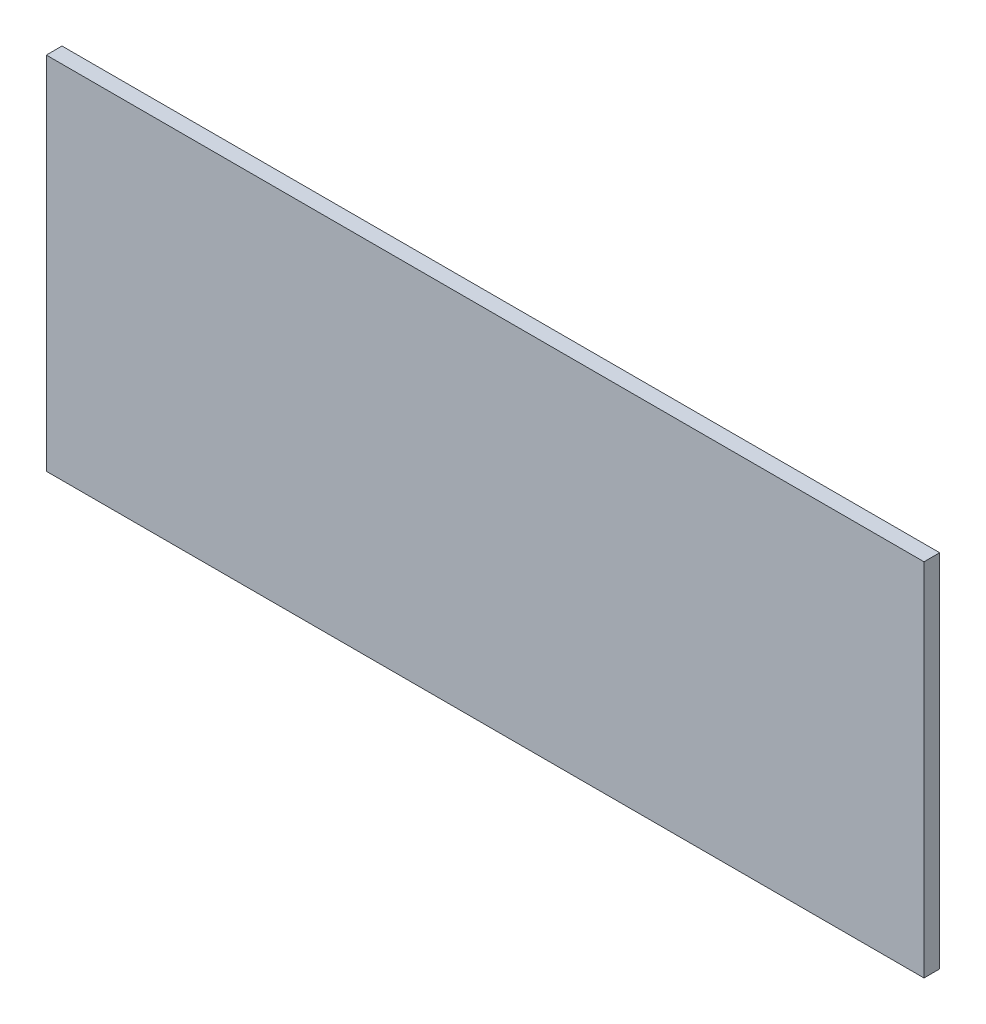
from build123d import *

# Parameters (mm, degrees)
SKETCH1_W      = 1066.8
SKETCH1_H      = 438.15
EXTRUDE1_DEPTH = 19.05


with BuildPart() as part:
    # Sketch1 → Extrude1 (new body)
    with BuildSketch(Plane.XY):
        with Locations((533.4, 219.075)):
            Rectangle(SKETCH1_W, SKETCH1_H)
    extrude(amount=EXTRUDE1_DEPTH)


solid = part.part
